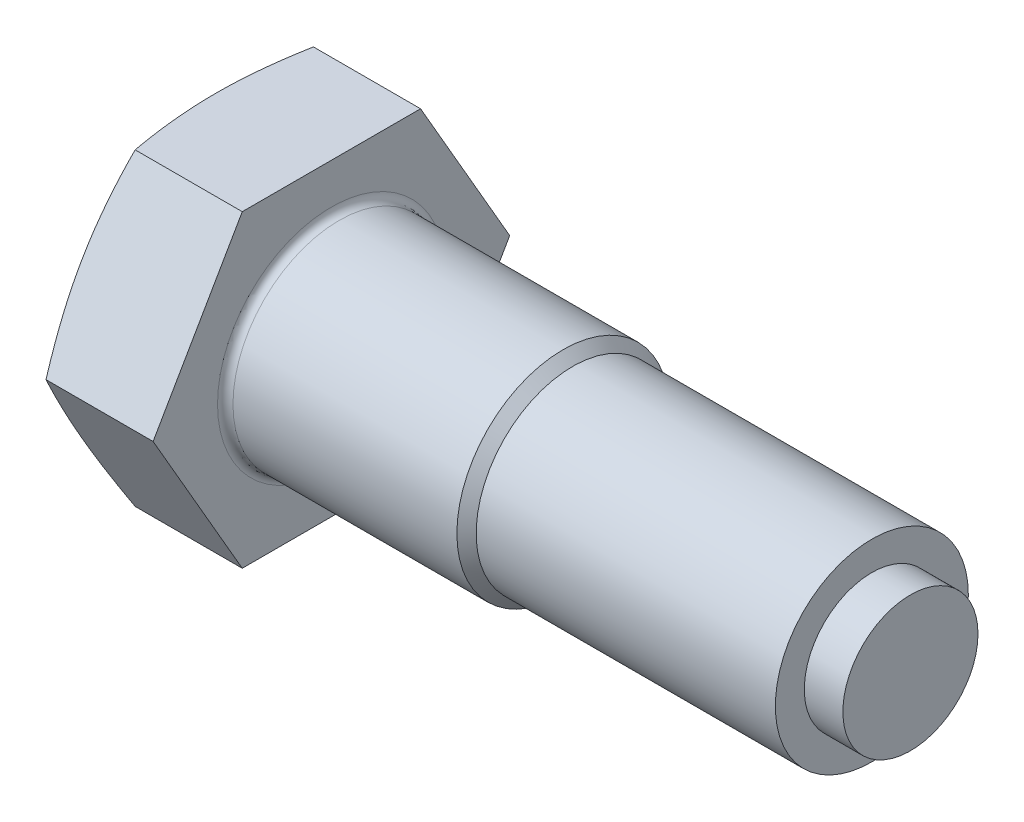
ISO-10303-21;
HEADER;
FILE_DESCRIPTION(('STEP AP214'),'2;1');
FILE_NAME('part.step','',(''),(''),'','','');
FILE_SCHEMA(('AUTOMOTIVE_DESIGN { 1 0 10303 214 1 1 1 1 }'));
ENDSEC;
DATA;
#1=APPLICATION_CONTEXT('core data for automotive mechanical design processes');
#2=APPLICATION_PROTOCOL_DEFINITION('international standard','automotive_design',2000,#1);
#3=PRODUCT_CONTEXT('',#1,'mechanical');
#4=PRODUCT('Part','Part','',(#3));
#5=PRODUCT_RELATED_PRODUCT_CATEGORY('part','',(#4));
#6=PRODUCT_DEFINITION_FORMATION('','',#4);
#7=PRODUCT_DEFINITION_CONTEXT('part definition',#1,'design');
#8=PRODUCT_DEFINITION('design','',#6,#7);
#9=PRODUCT_DEFINITION_SHAPE('','',#8);
#10=(LENGTH_UNIT() NAMED_UNIT(*) SI_UNIT(.MILLI.,.METRE.));
#11=(NAMED_UNIT(*) PLANE_ANGLE_UNIT() SI_UNIT($,.RADIAN.));
#12=(NAMED_UNIT(*) SI_UNIT($,.STERADIAN.) SOLID_ANGLE_UNIT());
#13=UNCERTAINTY_MEASURE_WITH_UNIT(LENGTH_MEASURE(1.E-05),#10,'distance_accuracy_value','');
#14=(GEOMETRIC_REPRESENTATION_CONTEXT(3) GLOBAL_UNCERTAINTY_ASSIGNED_CONTEXT((#13)) GLOBAL_UNIT_ASSIGNED_CONTEXT((#10,
#11,#12)) REPRESENTATION_CONTEXT('',''));
#15=CARTESIAN_POINT('',(0.,0.,0.));
#16=DIRECTION('',(0.,0.,1.));
#17=DIRECTION('',(1.,0.,0.));
#18=AXIS2_PLACEMENT_3D('',#15,#16,#17);
#19=CARTESIAN_POINT('',(6.,-8.,-4.61880215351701));
#20=DIRECTION('',(0.,0.5,0.866025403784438));
#21=DIRECTION('',(0.,-0.866025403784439,0.5));
#22=AXIS2_PLACEMENT_3D('',#19,#20,#21);
#23=PLANE('',#22);
#24=CARTESIAN_POINT('',(0.450493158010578,0.00020000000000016,-9.23771977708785));
#25=CARTESIAN_POINT('',(0.380845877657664,-0.331114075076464,-9.04643550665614));
#26=CARTESIAN_POINT('',(0.317489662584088,-0.663520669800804,-8.85452046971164));
#27=CARTESIAN_POINT('',(0.206024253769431,-1.33049516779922,-8.46944256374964));
#28=CARTESIAN_POINT('',(0.157926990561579,-1.66506455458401,-8.27627883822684));
#29=CARTESIAN_POINT('',(0.0801310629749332,-2.33265174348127,-7.89084719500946));
#30=CARTESIAN_POINT('',(0.0502627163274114,-2.66565429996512,-7.69858807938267));
#31=CARTESIAN_POINT('',(0.0102008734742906,-3.33243813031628,-7.31362025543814));
#32=CARTESIAN_POINT('',(0.,-3.66621906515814,-7.12091174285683));
#33=CARTESIAN_POINT('',(0.,-4.33378093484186,-6.7354947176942));
#34=CARTESIAN_POINT('',(0.0102008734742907,-4.66756186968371,-6.54278620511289));
#35=CARTESIAN_POINT('',(0.0502627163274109,-5.33434570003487,-6.15781838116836));
#36=CARTESIAN_POINT('',(0.0801310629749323,-5.66734825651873,-5.96555926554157));
#37=CARTESIAN_POINT('',(0.157926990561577,-6.33493544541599,-5.58012762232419));
#38=CARTESIAN_POINT('',(0.20602425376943,-6.66950483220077,-5.38696389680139));
#39=CARTESIAN_POINT('',(0.317489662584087,-7.33647933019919,-5.00188599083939));
#40=CARTESIAN_POINT('',(0.380845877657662,-7.66888592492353,-4.80997095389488));
#41=CARTESIAN_POINT('',(0.450493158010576,-8.0002,-4.61868668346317));
#42=B_SPLINE_CURVE_WITH_KNOTS('',3,(#24,#25,#26,#27,#28,#29,#30,#31,#32,#33,#34,#35,#36,#37,#38,
#39,#40,#41),.UNSPECIFIED.,.F.,.F.,(4,2,2,2,2,2,2,2,4),(0.,1.16669003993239,2.33429004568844,
3.4908488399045,4.6469737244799,5.80309860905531,6.95965740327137,8.12725740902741,
9.2939474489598),.UNSPECIFIED.);
#43=CARTESIAN_POINT('',(0.450451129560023,0.,-9.23760430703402));
#44=VERTEX_POINT('',#43);
#45=CARTESIAN_POINT('',(0.,-4.,-6.92820323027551));
#46=VERTEX_POINT('',#45);
#47=EDGE_CURVE('E113',#44,#46,#42,.T.);
#48=ORIENTED_EDGE('',*,*,#47,.F.);
#49=DIRECTION('',(-1.,0.,0.));
#50=VECTOR('',#49,1.);
#51=CARTESIAN_POINT('',(6.,0.,-9.23760430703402));
#52=LINE('',#51,#50);
#53=CARTESIAN_POINT('',(6.,0.,-9.23760430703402));
#54=VERTEX_POINT('',#53);
#55=EDGE_CURVE('E142',#54,#44,#52,.T.);
#56=ORIENTED_EDGE('',*,*,#55,.F.);
#57=DIRECTION('',(0.,0.866025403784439,-0.5));
#58=VECTOR('',#57,1.);
#59=CARTESIAN_POINT('',(6.,-8.,-4.61880215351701));
#60=LINE('',#59,#58);
#61=CARTESIAN_POINT('',(6.,-8.,-4.61880215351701));
#62=VERTEX_POINT('',#61);
#63=EDGE_CURVE('E179',#62,#54,#60,.T.);
#64=ORIENTED_EDGE('',*,*,#63,.F.);
#65=DIRECTION('',(-1.,0.,0.));
#66=VECTOR('',#65,1.);
#67=CARTESIAN_POINT('',(6.,-8.,-4.61880215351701));
#68=LINE('',#67,#66);
#69=CARTESIAN_POINT('',(0.450451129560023,-8.,-4.61880215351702));
#70=VERTEX_POINT('',#69);
#71=EDGE_CURVE('E136',#62,#70,#68,.T.);
#72=ORIENTED_EDGE('',*,*,#71,.T.);
#73=EDGE_CURVE('E200',#46,#70,#42,.T.);
#74=ORIENTED_EDGE('',*,*,#73,.F.);
#75=EDGE_LOOP('',(#48,#56,#64,#72,#74));
#76=FACE_BOUND('',#75,.T.);
#77=ADVANCED_FACE('F35',(#76),#23,.F.);
#78=CARTESIAN_POINT('',(6.,0.,-9.23760430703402));
#79=DIRECTION('',(0.,-0.5,0.866025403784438));
#80=DIRECTION('',(0.,-0.866025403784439,-0.5));
#81=AXIS2_PLACEMENT_3D('',#78,#79,#80);
#82=PLANE('',#81);
#83=CARTESIAN_POINT('',(0.450493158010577,8.0002,-4.61868668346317));
#84=CARTESIAN_POINT('',(0.380845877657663,7.66888592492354,-4.80997095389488));
#85=CARTESIAN_POINT('',(0.317489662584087,7.3364793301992,-5.00188599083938));
#86=CARTESIAN_POINT('',(0.206024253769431,6.66950483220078,-5.38696389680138));
#87=CARTESIAN_POINT('',(0.157926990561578,6.33493544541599,-5.58012762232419));
#88=CARTESIAN_POINT('',(0.0801310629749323,5.66734825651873,-5.96555926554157));
#89=CARTESIAN_POINT('',(0.0502627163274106,5.33434570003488,-6.15781838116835));
#90=CARTESIAN_POINT('',(0.0102008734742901,4.66756186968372,-6.54278620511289));
#91=CARTESIAN_POINT('',(0.,4.33378093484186,-6.7354947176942));
#92=CARTESIAN_POINT('',(0.,3.66621906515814,-7.12091174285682));
#93=CARTESIAN_POINT('',(0.0102008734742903,3.33243813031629,-7.31362025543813));
#94=CARTESIAN_POINT('',(0.050262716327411,2.66565429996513,-7.69858807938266));
#95=CARTESIAN_POINT('',(0.080131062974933,2.33265174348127,-7.89084719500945));
#96=CARTESIAN_POINT('',(0.157926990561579,1.66506455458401,-8.27627883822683));
#97=CARTESIAN_POINT('',(0.206024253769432,1.33049516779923,-8.46944256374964));
#98=CARTESIAN_POINT('',(0.317489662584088,0.663520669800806,-8.85452046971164));
#99=CARTESIAN_POINT('',(0.380845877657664,0.331114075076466,-9.04643550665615));
#100=CARTESIAN_POINT('',(0.450493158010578,-0.000199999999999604,-9.23771977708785));
#101=B_SPLINE_CURVE_WITH_KNOTS('',3,(#83,#84,#85,#86,#87,#88,#89,#90,#91,#92,#93,#94,#95,#96,
#97,#98,#99,#100),.UNSPECIFIED.,.F.,.F.,(4,2,2,2,2,2,2,2,4),(0.,1.16669003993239,
2.33429004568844,3.4908488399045,4.6469737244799,5.80309860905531,6.95965740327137,
8.12725740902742,9.29394744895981),.UNSPECIFIED.);
#102=CARTESIAN_POINT('',(0.450451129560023,8.,-4.61880215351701));
#103=VERTEX_POINT('',#102);
#104=CARTESIAN_POINT('',(0.,4.,-6.92820323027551));
#105=VERTEX_POINT('',#104);
#106=EDGE_CURVE('E252',#103,#105,#101,.T.);
#107=ORIENTED_EDGE('',*,*,#106,.F.);
#108=DIRECTION('',(-1.,0.,0.));
#109=VECTOR('',#108,1.);
#110=CARTESIAN_POINT('',(6.,8.,-4.618802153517));
#111=LINE('',#110,#109);
#112=CARTESIAN_POINT('',(6.,8.,-4.618802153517));
#113=VERTEX_POINT('',#112);
#114=EDGE_CURVE('E133',#113,#103,#111,.T.);
#115=ORIENTED_EDGE('',*,*,#114,.F.);
#116=DIRECTION('',(0.,0.866025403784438,0.5));
#117=VECTOR('',#116,1.);
#118=CARTESIAN_POINT('',(6.,0.,-9.23760430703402));
#119=LINE('',#118,#117);
#120=EDGE_CURVE('E182',#54,#113,#119,.T.);
#121=ORIENTED_EDGE('',*,*,#120,.F.);
#122=ORIENTED_EDGE('',*,*,#55,.T.);
#123=EDGE_CURVE('E125',#105,#44,#101,.T.);
#124=ORIENTED_EDGE('',*,*,#123,.F.);
#125=EDGE_LOOP('',(#107,#115,#121,#122,#124));
#126=FACE_BOUND('',#125,.T.);
#127=ADVANCED_FACE('F258',(#126),#82,.F.);
#128=CARTESIAN_POINT('',(6.,8.,-4.618802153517));
#129=DIRECTION('',(0.,-1.,0.));
#130=DIRECTION('',(0.,0.,-1.));
#131=AXIS2_PLACEMENT_3D('',#128,#129,#130);
#132=PLANE('',#131);
#133=CARTESIAN_POINT('',(2.40703219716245,8.,-12.2289640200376));
#134=CARTESIAN_POINT('',(2.29681888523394,8.,-11.8670150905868));
#135=CARTESIAN_POINT('',(2.18789161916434,8.,-11.504667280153));
#136=CARTESIAN_POINT('',(1.97332061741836,8.,-10.778970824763));
#137=CARTESIAN_POINT('',(1.86767714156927,8.,-10.4156221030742));
#138=CARTESIAN_POINT('',(1.66020942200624,8.,-9.68709884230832));
#139=CARTESIAN_POINT('',(1.55839267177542,8.,-9.32192216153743));
#140=CARTESIAN_POINT('',(1.35977040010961,8.,-8.59021038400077));
#141=CARTESIAN_POINT('',(1.26296478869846,8.,-8.22367531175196));
#142=CARTESIAN_POINT('',(1.07676087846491,8.,-7.49353181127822));
#143=CARTESIAN_POINT('',(0.987285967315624,8.,-7.12994301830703));
#144=CARTESIAN_POINT('',(0.815953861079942,8.,-6.40095616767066));
#145=CARTESIAN_POINT('',(0.734096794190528,8.,-6.03555807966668));
#146=CARTESIAN_POINT('',(0.579908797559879,8.,-5.3028708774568));
#147=CARTESIAN_POINT('',(0.507574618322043,8.,-4.93558245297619));
#148=CARTESIAN_POINT('',(0.374634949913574,8.,-4.19887324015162));
#149=CARTESIAN_POINT('',(0.314029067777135,8.,-3.82945252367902));
#150=CARTESIAN_POINT('',(0.21300896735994,8.,-3.13007695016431));
#151=CARTESIAN_POINT('',(0.171092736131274,8.,-2.80034108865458));
#152=CARTESIAN_POINT('',(0.100138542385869,8.,-2.13947507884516));
#153=CARTESIAN_POINT('',(0.0711002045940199,8.,-1.80834497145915));
#154=CARTESIAN_POINT('',(0.0273002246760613,8.,-1.14536212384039));
#155=CARTESIAN_POINT('',(0.0125284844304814,8.,-0.81351006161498));
#156=CARTESIAN_POINT('',(-0.00199041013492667,8.,-0.149473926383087));
#157=CARTESIAN_POINT('',(-0.00173767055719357,8.,0.182710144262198));
#158=CARTESIAN_POINT('',(0.013818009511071,8.,0.848405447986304));
#159=CARTESIAN_POINT('',(0.0291972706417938,8.,1.18191486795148));
#160=CARTESIAN_POINT('',(0.074298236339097,8.,1.84795410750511));
#161=CARTESIAN_POINT('',(0.104020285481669,8.,2.18048390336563));
#162=CARTESIAN_POINT('',(0.176416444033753,8.,2.84439969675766));
#163=CARTESIAN_POINT('',(0.21910167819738,8.,3.17578446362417));
#164=CARTESIAN_POINT('',(0.315692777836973,8.,3.83689615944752));
#165=CARTESIAN_POINT('',(0.369598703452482,8.,4.16662307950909));
#166=CARTESIAN_POINT('',(0.489978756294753,8.,4.84177010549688));
#167=CARTESIAN_POINT('',(0.55696686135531,8.,5.18709775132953));
#168=CARTESIAN_POINT('',(0.699564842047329,8.,5.87597970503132));
#169=CARTESIAN_POINT('',(0.775175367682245,8.,6.21953387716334));
#170=CARTESIAN_POINT('',(0.933430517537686,8.,6.90511369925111));
#171=CARTESIAN_POINT('',(1.016077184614,8.,7.24713887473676));
#172=CARTESIAN_POINT('',(1.18706021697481,8.,7.92974842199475));
#173=CARTESIAN_POINT('',(1.27539644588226,8.,8.27033282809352));
#174=CARTESIAN_POINT('',(1.45681143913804,8.,8.95070023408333));
#175=CARTESIAN_POINT('',(1.54989614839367,8.00000000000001,9.29048164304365));
#176=CARTESIAN_POINT('',(1.73985237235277,8.00000000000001,9.96898283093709));
#177=CARTESIAN_POINT('',(1.83672390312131,8.00000000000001,10.3077026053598));
#178=CARTESIAN_POINT('',(2.03355925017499,8.00000000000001,10.9841773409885));
#179=CARTESIAN_POINT('',(2.13352253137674,8.00000000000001,11.3219324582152));
#180=CARTESIAN_POINT('',(2.33602454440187,8.00000000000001,11.996670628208));
#181=CARTESIAN_POINT('',(2.43856329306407,8.00000000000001,12.3336536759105));
#182=CARTESIAN_POINT('',(2.74708830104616,8.00000000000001,13.3361794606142));
#183=CARTESIAN_POINT('',(2.95617894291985,8.00000000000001,14.0007666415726));
#184=CARTESIAN_POINT('',(3.3802854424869,8.00000000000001,15.3280732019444));
#185=CARTESIAN_POINT('',(3.59530158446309,8.00000000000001,15.9907924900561));
#186=CARTESIAN_POINT('',(4.02885489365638,8.00000000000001,17.3122918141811));
#187=CARTESIAN_POINT('',(4.24737560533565,8.00000000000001,17.9710772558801));
#188=CARTESIAN_POINT('',(4.57758071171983,8.00000000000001,18.9584130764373));
#189=CARTESIAN_POINT('',(4.6880485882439,8.00000000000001,19.2873713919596));
#190=CARTESIAN_POINT('',(4.90969914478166,8.00000000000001,19.9450462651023));
#191=CARTESIAN_POINT('',(5.02088182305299,8.00000000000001,20.2737628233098));
#192=CARTESIAN_POINT('',(5.13237415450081,8.00000000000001,20.6023743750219));
#193=B_SPLINE_CURVE_WITH_KNOTS('',3,(#133,#134,#135,#136,#137,#138,#139,#140,#141,#142,#143,
#144,#145,#146,#147,#148,#149,#150,#151,#152,#153,#154,#155,#156,#157,#158,#159,#160,#161,#162,
#163,#164,#165,#166,#167,#168,#169,#170,#171,#172,#173,#174,#175,#176,#177,#178,#179,#180,#181,
#182,#183,#184,#185,#186,#187,#188,#189,#190,#191,#192),.UNSPECIFIED.,.F.,.F.,(4,2,2,2,2,2,2,2,
2,2,2,2,2,2,2,2,2,2,2,2,2,2,2,2,2,2,2,2,2,4),(0.,1.13507897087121,2.27024752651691,
3.40753402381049,4.54480009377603,5.66804425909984,6.79130732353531,7.91418609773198,
9.0370272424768,10.033976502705,11.0308967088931,12.0271107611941,13.0233177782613,
14.0245770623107,15.0258604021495,16.0280054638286,17.0301558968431,18.0853158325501,
19.1405553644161,20.1961023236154,21.2516239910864,22.3085012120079,23.3653829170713,
24.4220827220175,25.4787894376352,27.5688531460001,29.6590173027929,31.7412506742,
32.7822834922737,33.8233137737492),.UNSPECIFIED.);
#194=CARTESIAN_POINT('',(0.450451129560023,8.00000000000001,4.618802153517));
#195=VERTEX_POINT('',#194);
#196=CARTESIAN_POINT('',(0.,8.,0.));
#197=VERTEX_POINT('',#196);
#198=EDGE_CURVE('E50',#195,#197,#193,.F.);
#199=ORIENTED_EDGE('',*,*,#198,.F.);
#200=DIRECTION('',(-1.,0.,0.));
#201=VECTOR('',#200,1.);
#202=CARTESIAN_POINT('',(6.,8.,4.618802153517));
#203=LINE('',#202,#201);
#204=CARTESIAN_POINT('',(6.,8.,4.618802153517));
#205=VERTEX_POINT('',#204);
#206=EDGE_CURVE('E130',#205,#195,#203,.T.);
#207=ORIENTED_EDGE('',*,*,#206,.F.);
#208=DIRECTION('',(0.,0.,1.));
#209=VECTOR('',#208,1.);
#210=CARTESIAN_POINT('',(6.,8.,-4.618802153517));
#211=LINE('',#210,#209);
#212=EDGE_CURVE('E188',#113,#205,#211,.T.);
#213=ORIENTED_EDGE('',*,*,#212,.F.);
#214=ORIENTED_EDGE('',*,*,#114,.T.);
#215=EDGE_CURVE('E253',#197,#103,#193,.F.);
#216=ORIENTED_EDGE('',*,*,#215,.F.);
#217=EDGE_LOOP('',(#199,#207,#213,#214,#216));
#218=FACE_BOUND('',#217,.T.);
#219=ADVANCED_FACE('F261',(#218),#132,.F.);
#220=CARTESIAN_POINT('',(6.,8.,4.618802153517));
#221=DIRECTION('',(0.,-0.5,-0.866025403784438));
#222=DIRECTION('',(0.,0.866025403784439,-0.5));
#223=AXIS2_PLACEMENT_3D('',#220,#221,#222);
#224=PLANE('',#223);
#225=CARTESIAN_POINT('',(0.450493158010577,-0.000200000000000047,9.23771977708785));
#226=CARTESIAN_POINT('',(0.380845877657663,0.331114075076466,9.04643550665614));
#227=CARTESIAN_POINT('',(0.317489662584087,0.663520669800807,8.85452046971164));
#228=CARTESIAN_POINT('',(0.206024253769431,1.33049516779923,8.46944256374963));
#229=CARTESIAN_POINT('',(0.157926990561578,1.66506455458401,8.27627883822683));
#230=CARTESIAN_POINT('',(0.0801310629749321,2.33265174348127,7.89084719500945));
#231=CARTESIAN_POINT('',(0.0502627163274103,2.66565429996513,7.69858807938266));
#232=CARTESIAN_POINT('',(0.0102008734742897,3.33243813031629,7.31362025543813));
#233=CARTESIAN_POINT('',(0.,3.66621906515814,7.12091174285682));
#234=CARTESIAN_POINT('',(0.,4.33378093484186,6.7354947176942));
#235=CARTESIAN_POINT('',(0.0102008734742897,4.66756186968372,6.54278620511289));
#236=CARTESIAN_POINT('',(0.0502627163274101,5.33434570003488,6.15781838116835));
#237=CARTESIAN_POINT('',(0.0801310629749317,5.66734825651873,5.96555926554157));
#238=CARTESIAN_POINT('',(0.157926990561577,6.33493544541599,5.58012762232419));
#239=CARTESIAN_POINT('',(0.206024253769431,6.66950483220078,5.38696389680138));
#240=CARTESIAN_POINT('',(0.317489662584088,7.3364793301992,5.00188599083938));
#241=CARTESIAN_POINT('',(0.380845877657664,7.66888592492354,4.80997095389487));
#242=CARTESIAN_POINT('',(0.450493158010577,8.0002,4.61868668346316));
#243=B_SPLINE_CURVE_WITH_KNOTS('',3,(#225,#226,#227,#228,#229,#230,#231,#232,#233,#234,#235,
#236,#237,#238,#239,#240,#241,#242),.UNSPECIFIED.,.F.,.F.,(4,2,2,2,2,2,2,2,4),(0.,
1.16669003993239,2.33429004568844,3.4908488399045,4.64697372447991,5.80309860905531,
6.95965740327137,8.12725740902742,9.29394744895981),.UNSPECIFIED.);
#244=CARTESIAN_POINT('',(0.450451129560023,0.,9.23760430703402));
#245=VERTEX_POINT('',#244);
#246=CARTESIAN_POINT('',(0.,4.,6.92820323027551));
#247=VERTEX_POINT('',#246);
#248=EDGE_CURVE('E58',#245,#247,#243,.T.);
#249=ORIENTED_EDGE('',*,*,#248,.F.);
#250=DIRECTION('',(-1.,0.,0.));
#251=VECTOR('',#250,1.);
#252=CARTESIAN_POINT('',(6.,0.,9.23760430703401));
#253=LINE('',#252,#251);
#254=CARTESIAN_POINT('',(6.,0.,9.23760430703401));
#255=VERTEX_POINT('',#254);
#256=EDGE_CURVE('E121',#255,#245,#253,.T.);
#257=ORIENTED_EDGE('',*,*,#256,.F.);
#258=DIRECTION('',(0.,-0.866025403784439,0.5));
#259=VECTOR('',#258,1.);
#260=CARTESIAN_POINT('',(6.,8.,4.618802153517));
#261=LINE('',#260,#259);
#262=EDGE_CURVE('E190',#205,#255,#261,.T.);
#263=ORIENTED_EDGE('',*,*,#262,.F.);
#264=ORIENTED_EDGE('',*,*,#206,.T.);
#265=EDGE_CURVE('E124',#247,#195,#243,.T.);
#266=ORIENTED_EDGE('',*,*,#265,.F.);
#267=EDGE_LOOP('',(#249,#257,#263,#264,#266));
#268=FACE_BOUND('',#267,.T.);
#269=ADVANCED_FACE('F119',(#268),#224,.F.);
#270=CARTESIAN_POINT('',(6.,0.,9.23760430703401));
#271=DIRECTION('',(0.,0.5,-0.866025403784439));
#272=DIRECTION('',(0.,0.866025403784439,0.5));
#273=AXIS2_PLACEMENT_3D('',#270,#271,#272);
#274=PLANE('',#273);
#275=CARTESIAN_POINT('',(0.450493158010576,-8.0002,4.61868668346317));
#276=CARTESIAN_POINT('',(0.380845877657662,-7.66888592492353,4.80997095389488));
#277=CARTESIAN_POINT('',(0.317489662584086,-7.33647933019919,5.00188599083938));
#278=CARTESIAN_POINT('',(0.206024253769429,-6.66950483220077,5.38696389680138));
#279=CARTESIAN_POINT('',(0.157926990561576,-6.33493544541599,5.58012762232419));
#280=CARTESIAN_POINT('',(0.0801310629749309,-5.66734825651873,5.96555926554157));
#281=CARTESIAN_POINT('',(0.0502627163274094,-5.33434570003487,6.15781838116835));
#282=CARTESIAN_POINT('',(0.0102008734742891,-4.66756186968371,6.54278620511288));
#283=CARTESIAN_POINT('',(0.,-4.33378093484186,6.7354947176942));
#284=CARTESIAN_POINT('',(0.,-3.66621906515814,7.12091174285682));
#285=CARTESIAN_POINT('',(0.010200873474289,-3.33243813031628,7.31362025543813));
#286=CARTESIAN_POINT('',(0.0502627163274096,-2.66565429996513,7.69858807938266));
#287=CARTESIAN_POINT('',(0.0801310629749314,-2.33265174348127,7.89084719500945));
#288=CARTESIAN_POINT('',(0.157926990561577,-1.66506455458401,8.27627883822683));
#289=CARTESIAN_POINT('',(0.20602425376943,-1.33049516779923,8.46944256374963));
#290=CARTESIAN_POINT('',(0.317489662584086,-0.663520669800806,8.85452046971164));
#291=CARTESIAN_POINT('',(0.380845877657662,-0.331114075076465,9.04643550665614));
#292=CARTESIAN_POINT('',(0.450493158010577,0.000199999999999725,9.23771977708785));
#293=B_SPLINE_CURVE_WITH_KNOTS('',3,(#275,#276,#277,#278,#279,#280,#281,#282,#283,#284,#285,
#286,#287,#288,#289,#290,#291,#292),.UNSPECIFIED.,.F.,.F.,(4,2,2,2,2,2,2,2,4),(0.,
1.16669003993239,2.33429004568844,3.4908488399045,4.6469737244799,5.80309860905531,
6.95965740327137,8.12725740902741,9.29394744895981),.UNSPECIFIED.);
#294=CARTESIAN_POINT('',(0.450451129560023,-8.,4.61880215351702));
#295=VERTEX_POINT('',#294);
#296=CARTESIAN_POINT('',(0.,-4.,6.92820323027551));
#297=VERTEX_POINT('',#296);
#298=EDGE_CURVE('E115',#295,#297,#293,.T.);
#299=ORIENTED_EDGE('',*,*,#298,.F.);
#300=DIRECTION('',(-1.,0.,0.));
#301=VECTOR('',#300,1.);
#302=CARTESIAN_POINT('',(6.,-8.,4.618802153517));
#303=LINE('',#302,#301);
#304=CARTESIAN_POINT('',(6.,-8.,4.618802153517));
#305=VERTEX_POINT('',#304);
#306=EDGE_CURVE('E131',#305,#295,#303,.T.);
#307=ORIENTED_EDGE('',*,*,#306,.F.);
#308=DIRECTION('',(0.,-0.866025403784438,-0.5));
#309=VECTOR('',#308,1.);
#310=CARTESIAN_POINT('',(6.,0.,9.23760430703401));
#311=LINE('',#310,#309);
#312=EDGE_CURVE('E129',#255,#305,#311,.T.);
#313=ORIENTED_EDGE('',*,*,#312,.F.);
#314=ORIENTED_EDGE('',*,*,#256,.T.);
#315=EDGE_CURVE('E105',#297,#245,#293,.T.);
#316=ORIENTED_EDGE('',*,*,#315,.F.);
#317=EDGE_LOOP('',(#299,#307,#313,#314,#316));
#318=FACE_BOUND('',#317,.T.);
#319=ADVANCED_FACE('F127',(#318),#274,.F.);
#320=CARTESIAN_POINT('',(6.,-8.,4.618802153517));
#321=DIRECTION('',(0.,1.,0.));
#322=DIRECTION('',(0.,0.,1.));
#323=AXIS2_PLACEMENT_3D('',#320,#321,#322);
#324=PLANE('',#323);
#325=CARTESIAN_POINT('',(2.40703219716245,-7.99999999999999,-12.2289640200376));
#326=CARTESIAN_POINT('',(2.29681888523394,-7.99999999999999,-11.8670150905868));
#327=CARTESIAN_POINT('',(2.18789161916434,-7.99999999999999,-11.504667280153));
#328=CARTESIAN_POINT('',(1.97332061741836,-7.99999999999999,-10.778970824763));
#329=CARTESIAN_POINT('',(1.86767714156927,-7.99999999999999,-10.4156221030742));
#330=CARTESIAN_POINT('',(1.66020942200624,-7.99999999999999,-9.68709884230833));
#331=CARTESIAN_POINT('',(1.55839267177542,-8.,-9.32192216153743));
#332=CARTESIAN_POINT('',(1.35977040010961,-8.,-8.59021038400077));
#333=CARTESIAN_POINT('',(1.26296478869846,-8.,-8.22367531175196));
#334=CARTESIAN_POINT('',(1.0767608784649,-8.,-7.49353181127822));
#335=CARTESIAN_POINT('',(0.987285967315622,-8.,-7.12994301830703));
#336=CARTESIAN_POINT('',(0.81595386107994,-8.,-6.40095616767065));
#337=CARTESIAN_POINT('',(0.734096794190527,-8.,-6.03555807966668));
#338=CARTESIAN_POINT('',(0.579908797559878,-8.,-5.3028708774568));
#339=CARTESIAN_POINT('',(0.507574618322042,-8.,-4.93558245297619));
#340=CARTESIAN_POINT('',(0.374634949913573,-8.,-4.19887324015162));
#341=CARTESIAN_POINT('',(0.314029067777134,-8.,-3.82945252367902));
#342=CARTESIAN_POINT('',(0.213008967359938,-8.,-3.13007695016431));
#343=CARTESIAN_POINT('',(0.171092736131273,-8.,-2.80034108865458));
#344=CARTESIAN_POINT('',(0.100138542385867,-8.,-2.13947507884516));
#345=CARTESIAN_POINT('',(0.0711002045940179,-8.,-1.80834497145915));
#346=CARTESIAN_POINT('',(0.0273002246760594,-8.,-1.14536212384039));
#347=CARTESIAN_POINT('',(0.0125284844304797,-8.,-0.813510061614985));
#348=CARTESIAN_POINT('',(-0.00199041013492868,-8.,-0.149473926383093));
#349=CARTESIAN_POINT('',(-0.00173767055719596,-8.,0.182710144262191));
#350=CARTESIAN_POINT('',(0.0138180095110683,-8.,0.848405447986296));
#351=CARTESIAN_POINT('',(0.0291972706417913,-8.,1.18191486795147));
#352=CARTESIAN_POINT('',(0.0742982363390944,-8.,1.8479541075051));
#353=CARTESIAN_POINT('',(0.104020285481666,-8.,2.18048390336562));
#354=CARTESIAN_POINT('',(0.176416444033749,-8.,2.84439969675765));
#355=CARTESIAN_POINT('',(0.219101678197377,-8.,3.17578446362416));
#356=CARTESIAN_POINT('',(0.315692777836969,-8.,3.83689615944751));
#357=CARTESIAN_POINT('',(0.369598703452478,-8.,4.16662307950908));
#358=CARTESIAN_POINT('',(0.48997875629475,-8.,4.84177010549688));
#359=CARTESIAN_POINT('',(0.556966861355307,-8.,5.18709775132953));
#360=CARTESIAN_POINT('',(0.699564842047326,-8.,5.87597970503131));
#361=CARTESIAN_POINT('',(0.775175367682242,-8.,6.21953387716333));
#362=CARTESIAN_POINT('',(0.933430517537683,-8.,6.90511369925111));
#363=CARTESIAN_POINT('',(1.01607718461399,-8.,7.24713887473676));
#364=CARTESIAN_POINT('',(1.18706021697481,-8.,7.92974842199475));
#365=CARTESIAN_POINT('',(1.27539644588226,-8.,8.27033282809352));
#366=CARTESIAN_POINT('',(1.45681143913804,-8.,8.95070023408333));
#367=CARTESIAN_POINT('',(1.54989614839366,-8.,9.29048164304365));
#368=CARTESIAN_POINT('',(1.73985237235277,-8.,9.96898283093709));
#369=CARTESIAN_POINT('',(1.83672390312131,-8.,10.3077026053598));
#370=CARTESIAN_POINT('',(2.03355925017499,-8.,10.9841773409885));
#371=CARTESIAN_POINT('',(2.13352253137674,-8.,11.3219324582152));
#372=CARTESIAN_POINT('',(2.33602454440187,-8.,11.996670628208));
#373=CARTESIAN_POINT('',(2.43856329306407,-8.,12.3336536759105));
#374=CARTESIAN_POINT('',(2.74708830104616,-8.,13.3361794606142));
#375=CARTESIAN_POINT('',(2.95617894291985,-8.,14.0007666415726));
#376=CARTESIAN_POINT('',(3.3802854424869,-8.,15.3280732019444));
#377=CARTESIAN_POINT('',(3.59530158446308,-8.,15.9907924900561));
#378=CARTESIAN_POINT('',(4.02885489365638,-8.,17.3122918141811));
#379=CARTESIAN_POINT('',(4.24737560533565,-8.,17.9710772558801));
#380=CARTESIAN_POINT('',(4.57758071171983,-8.,18.9584130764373));
#381=CARTESIAN_POINT('',(4.6880485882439,-8.,19.2873713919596));
#382=CARTESIAN_POINT('',(4.90969914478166,-8.,19.9450462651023));
#383=CARTESIAN_POINT('',(5.02088182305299,-8.,20.2737628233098));
#384=CARTESIAN_POINT('',(5.13237415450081,-8.,20.6023743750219));
#385=B_SPLINE_CURVE_WITH_KNOTS('',3,(#325,#326,#327,#328,#329,#330,#331,#332,#333,#334,#335,
#336,#337,#338,#339,#340,#341,#342,#343,#344,#345,#346,#347,#348,#349,#350,#351,#352,#353,#354,
#355,#356,#357,#358,#359,#360,#361,#362,#363,#364,#365,#366,#367,#368,#369,#370,#371,#372,#373,
#374,#375,#376,#377,#378,#379,#380,#381,#382,#383,#384),.UNSPECIFIED.,.F.,.F.,(4,2,2,2,2,2,2,2,
2,2,2,2,2,2,2,2,2,2,2,2,2,2,2,2,2,2,2,2,2,4),(0.,1.13507897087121,2.27024752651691,
3.4075340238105,4.54480009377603,5.66804425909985,6.79130732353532,7.91418609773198,
9.0370272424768,10.033976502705,11.0308967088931,12.0271107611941,13.0233177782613,
14.0245770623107,15.0258604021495,16.0280054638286,17.0301558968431,18.0853158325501,
19.1405553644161,20.1961023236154,21.2516239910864,22.3085012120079,23.3653829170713,
24.4220827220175,25.4787894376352,27.5688531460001,29.6590173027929,31.7412506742,
32.7822834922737,33.8233137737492),.UNSPECIFIED.);
#386=CARTESIAN_POINT('',(0.,-8.,0.));
#387=VERTEX_POINT('',#386);
#388=EDGE_CURVE('E208',#70,#387,#385,.T.);
#389=ORIENTED_EDGE('',*,*,#388,.F.);
#390=ORIENTED_EDGE('',*,*,#71,.F.);
#391=DIRECTION('',(0.,0.,-1.));
#392=VECTOR('',#391,1.);
#393=CARTESIAN_POINT('',(6.,-8.,4.618802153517));
#394=LINE('',#393,#392);
#395=EDGE_CURVE('E193',#305,#62,#394,.T.);
#396=ORIENTED_EDGE('',*,*,#395,.F.);
#397=ORIENTED_EDGE('',*,*,#306,.T.);
#398=EDGE_CURVE('E209',#387,#295,#385,.T.);
#399=ORIENTED_EDGE('',*,*,#398,.F.);
#400=EDGE_LOOP('',(#389,#390,#396,#397,#399));
#401=FACE_BOUND('',#400,.T.);
#402=ADVANCED_FACE('F205',(#401),#324,.F.);
#403=CARTESIAN_POINT('',(80.142135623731,0.,0.));
#404=DIRECTION('',(-1.,0.,0.));
#405=DIRECTION('',(0.,0.,1.));
#406=AXIS2_PLACEMENT_3D('',#403,#404,#405);
#407=CYLINDRICAL_SURFACE('',#406,5.);
#408=CARTESIAN_POINT('',(18.5,0.,0.));
#409=DIRECTION('',(1.,0.,0.));
#410=DIRECTION('',(0.,0.,-1.));
#411=AXIS2_PLACEMENT_3D('',#408,#409,#410);
#412=CIRCLE('',#411,5.);
#413=CARTESIAN_POINT('',(18.5,0.,-5.));
#414=VERTEX_POINT('',#413);
#415=EDGE_CURVE('E13',#414,#414,#412,.T.);
#416=ORIENTED_EDGE('',*,*,#415,.T.);
#417=EDGE_LOOP('',(#416));
#418=FACE_BOUND('',#417,.T.);
#419=CARTESIAN_POINT('',(34.,0.,0.));
#420=DIRECTION('',(1.,0.,0.));
#421=DIRECTION('',(0.,0.,-1.));
#422=AXIS2_PLACEMENT_3D('',#419,#420,#421);
#423=CIRCLE('',#422,5.);
#424=CARTESIAN_POINT('',(34.,0.,-5.));
#425=VERTEX_POINT('',#424);
#426=EDGE_CURVE('E146',#425,#425,#423,.T.);
#427=ORIENTED_EDGE('',*,*,#426,.F.);
#428=EDGE_LOOP('',(#427));
#429=FACE_BOUND('',#428,.T.);
#430=ADVANCED_FACE('F273',(#418,#429),#407,.T.);
#431=CARTESIAN_POINT('',(6.,0.,-9.23760430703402));
#432=DIRECTION('',(1.,0.,0.));
#433=DIRECTION('',(0.,0.,-1.));
#434=AXIS2_PLACEMENT_3D('',#431,#432,#433);
#435=PLANE('',#434);
#436=CARTESIAN_POINT('',(6.,0.,0.));
#437=DIRECTION('',(1.,0.,0.));
#438=DIRECTION('',(0.,0.,-1.));
#439=AXIS2_PLACEMENT_3D('',#436,#437,#438);
#440=CIRCLE('',#439,5.9);
#441=CARTESIAN_POINT('',(6.,0.,-5.9));
#442=VERTEX_POINT('',#441);
#443=EDGE_CURVE('E43',#442,#442,#440,.F.);
#444=ORIENTED_EDGE('',*,*,#443,.T.);
#445=EDGE_LOOP('',(#444));
#446=FACE_BOUND('',#445,.T.);
#447=ORIENTED_EDGE('',*,*,#63,.T.);
#448=ORIENTED_EDGE('',*,*,#120,.T.);
#449=ORIENTED_EDGE('',*,*,#212,.T.);
#450=ORIENTED_EDGE('',*,*,#262,.T.);
#451=ORIENTED_EDGE('',*,*,#312,.T.);
#452=ORIENTED_EDGE('',*,*,#395,.T.);
#453=EDGE_LOOP('',(#447,#448,#449,#450,#451,#452));
#454=FACE_BOUND('',#453,.T.);
#455=ADVANCED_FACE('F160',(#446,#454),#435,.T.);
#456=CARTESIAN_POINT('',(18.,0.,0.));
#457=DIRECTION('',(-1.,0.,0.));
#458=DIRECTION('',(0.,0.,1.));
#459=AXIS2_PLACEMENT_3D('',#456,#457,#458);
#460=CYLINDRICAL_SURFACE('',#459,5.5);
#461=CARTESIAN_POINT('',(6.4,0.,0.));
#462=DIRECTION('',(1.,0.,0.));
#463=DIRECTION('',(0.,0.,-1.));
#464=AXIS2_PLACEMENT_3D('',#461,#462,#463);
#465=CIRCLE('',#464,5.5);
#466=CARTESIAN_POINT('',(6.4,0.,-5.5));
#467=VERTEX_POINT('',#466);
#468=EDGE_CURVE('E155',#467,#467,#465,.T.);
#469=ORIENTED_EDGE('',*,*,#468,.T.);
#470=EDGE_LOOP('',(#469));
#471=FACE_BOUND('',#470,.T.);
#472=CARTESIAN_POINT('',(18.,0.,0.));
#473=DIRECTION('',(1.,0.,0.));
#474=DIRECTION('',(0.,0.,-1.));
#475=AXIS2_PLACEMENT_3D('',#472,#473,#474);
#476=CIRCLE('',#475,5.5);
#477=CARTESIAN_POINT('',(18.,0.,-5.5));
#478=VERTEX_POINT('',#477);
#479=EDGE_CURVE('E149',#478,#478,#476,.T.);
#480=ORIENTED_EDGE('',*,*,#479,.F.);
#481=EDGE_LOOP('',(#480));
#482=FACE_BOUND('',#481,.T.);
#483=ADVANCED_FACE('F171',(#471,#482),#460,.T.);
#484=CARTESIAN_POINT('',(34.,0.,0.));
#485=DIRECTION('',(1.,0.,0.));
#486=DIRECTION('',(0.,0.,-1.));
#487=AXIS2_PLACEMENT_3D('',#484,#485,#486);
#488=PLANE('',#487);
#489=CARTESIAN_POINT('',(34.,0.,0.));
#490=DIRECTION('',(1.,0.,0.));
#491=DIRECTION('',(0.,0.,-1.));
#492=AXIS2_PLACEMENT_3D('',#489,#490,#491);
#493=CIRCLE('',#492,3.5);
#494=CARTESIAN_POINT('',(34.,0.,-3.5));
#495=VERTEX_POINT('',#494);
#496=EDGE_CURVE('E150',#495,#495,#493,.T.);
#497=ORIENTED_EDGE('',*,*,#496,.F.);
#498=EDGE_LOOP('',(#497));
#499=FACE_BOUND('',#498,.T.);
#500=ORIENTED_EDGE('',*,*,#426,.T.);
#501=EDGE_LOOP('',(#500));
#502=FACE_BOUND('',#501,.T.);
#503=ADVANCED_FACE('F174',(#499,#502),#488,.T.);
#504=CARTESIAN_POINT('',(34.,0.,0.));
#505=DIRECTION('',(1.,0.,0.));
#506=DIRECTION('',(0.,0.,-1.));
#507=AXIS2_PLACEMENT_3D('',#504,#505,#506);
#508=CYLINDRICAL_SURFACE('',#507,3.5);
#509=ORIENTED_EDGE('',*,*,#496,.T.);
#510=EDGE_LOOP('',(#509));
#511=FACE_BOUND('',#510,.T.);
#512=CARTESIAN_POINT('',(36.,0.,0.));
#513=DIRECTION('',(1.,0.,0.));
#514=DIRECTION('',(0.,0.,-1.));
#515=AXIS2_PLACEMENT_3D('',#512,#513,#514);
#516=CIRCLE('',#515,3.5);
#517=CARTESIAN_POINT('',(36.,0.,-3.5));
#518=VERTEX_POINT('',#517);
#519=EDGE_CURVE('E416',#518,#518,#516,.T.);
#520=ORIENTED_EDGE('',*,*,#519,.F.);
#521=EDGE_LOOP('',(#520));
#522=FACE_BOUND('',#521,.T.);
#523=ADVANCED_FACE('F233',(#511,#522),#508,.T.);
#524=CARTESIAN_POINT('',(36.,0.,-9.23760430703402));
#525=DIRECTION('',(1.,0.,0.));
#526=DIRECTION('',(0.,0.,-1.));
#527=AXIS2_PLACEMENT_3D('',#524,#525,#526);
#528=PLANE('',#527);
#529=ORIENTED_EDGE('',*,*,#519,.T.);
#530=EDGE_LOOP('',(#529));
#531=FACE_BOUND('',#530,.T.);
#532=ADVANCED_FACE('F313',(#531),#528,.T.);
#533=CARTESIAN_POINT('',(0.,0.,0.));
#534=DIRECTION('',(1.,0.,0.));
#535=DIRECTION('',(0.,0.,-1.));
#536=AXIS2_PLACEMENT_3D('',#533,#534,#535);
#537=CONICAL_SURFACE('',#536,8.,1.22173047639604);
#538=ORIENTED_EDGE('',*,*,#123,.T.);
#539=ORIENTED_EDGE('',*,*,#47,.T.);
#540=CARTESIAN_POINT('',(0.,0.,0.));
#541=DIRECTION('',(1.,0.,0.));
#542=DIRECTION('',(0.,0.,-1.));
#543=AXIS2_PLACEMENT_3D('',#540,#541,#542);
#544=CIRCLE('',#543,8.);
#545=EDGE_CURVE('E145',#46,#105,#544,.T.);
#546=ORIENTED_EDGE('',*,*,#545,.T.);
#547=EDGE_LOOP('',(#538,#539,#546));
#548=FACE_BOUND('',#547,.T.);
#549=ADVANCED_FACE('F307',(#548),#537,.T.);
#550=ORIENTED_EDGE('',*,*,#73,.T.);
#551=ORIENTED_EDGE('',*,*,#388,.T.);
#552=EDGE_CURVE('E153',#387,#46,#544,.T.);
#553=ORIENTED_EDGE('',*,*,#552,.T.);
#554=EDGE_LOOP('',(#550,#551,#553));
#555=FACE_BOUND('',#554,.T.);
#556=ADVANCED_FACE('F312',(#555),#537,.T.);
#557=ORIENTED_EDGE('',*,*,#298,.T.);
#558=EDGE_CURVE('E428',#297,#387,#544,.T.);
#559=ORIENTED_EDGE('',*,*,#558,.T.);
#560=ORIENTED_EDGE('',*,*,#398,.T.);
#561=EDGE_LOOP('',(#557,#559,#560));
#562=FACE_BOUND('',#561,.T.);
#563=ADVANCED_FACE('F231',(#562),#537,.T.);
#564=ORIENTED_EDGE('',*,*,#248,.T.);
#565=EDGE_CURVE('E108',#247,#297,#544,.T.);
#566=ORIENTED_EDGE('',*,*,#565,.T.);
#567=ORIENTED_EDGE('',*,*,#315,.T.);
#568=EDGE_LOOP('',(#564,#566,#567));
#569=FACE_BOUND('',#568,.T.);
#570=ADVANCED_FACE('F106',(#569),#537,.T.);
#571=ORIENTED_EDGE('',*,*,#198,.T.);
#572=CARTESIAN_POINT('',(0.,0.,0.));
#573=DIRECTION('',(-1.,0.,0.));
#574=DIRECTION('',(0.,0.,1.));
#575=AXIS2_PLACEMENT_3D('',#572,#573,#574);
#576=CIRCLE('',#575,8.);
#577=EDGE_CURVE('E212',#247,#197,#576,.T.);
#578=ORIENTED_EDGE('',*,*,#577,.F.);
#579=ORIENTED_EDGE('',*,*,#265,.T.);
#580=EDGE_LOOP('',(#571,#578,#579));
#581=FACE_BOUND('',#580,.T.);
#582=ADVANCED_FACE('F226',(#581),#537,.T.);
#583=ORIENTED_EDGE('',*,*,#215,.T.);
#584=ORIENTED_EDGE('',*,*,#106,.T.);
#585=EDGE_CURVE('E154',#105,#197,#544,.T.);
#586=ORIENTED_EDGE('',*,*,#585,.T.);
#587=EDGE_LOOP('',(#583,#584,#586));
#588=FACE_BOUND('',#587,.T.);
#589=ADVANCED_FACE('F230',(#588),#537,.T.);
#590=CARTESIAN_POINT('',(0.,0.,-9.23760430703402));
#591=DIRECTION('',(1.,0.,0.));
#592=DIRECTION('',(0.,0.,-1.));
#593=AXIS2_PLACEMENT_3D('',#590,#591,#592);
#594=PLANE('',#593);
#595=ORIENTED_EDGE('',*,*,#585,.F.);
#596=ORIENTED_EDGE('',*,*,#545,.F.);
#597=ORIENTED_EDGE('',*,*,#552,.F.);
#598=ORIENTED_EDGE('',*,*,#558,.F.);
#599=ORIENTED_EDGE('',*,*,#565,.F.);
#600=ORIENTED_EDGE('',*,*,#577,.T.);
#601=EDGE_LOOP('',(#595,#596,#597,#598,#599,#600));
#602=FACE_BOUND('',#601,.T.);
#603=ADVANCED_FACE('F167',(#602),#594,.F.);
#604=CARTESIAN_POINT('',(6.4,0.,0.));
#605=DIRECTION('',(1.,0.,0.));
#606=DIRECTION('',(0.,0.,-1.));
#607=AXIS2_PLACEMENT_3D('',#604,#605,#606);
#608=TOROIDAL_SURFACE('',#607,5.9,0.4);
#609=ORIENTED_EDGE('',*,*,#443,.F.);
#610=EDGE_LOOP('',(#609));
#611=FACE_BOUND('',#610,.T.);
#612=ORIENTED_EDGE('',*,*,#468,.F.);
#613=EDGE_LOOP('',(#612));
#614=FACE_BOUND('',#613,.T.);
#615=ADVANCED_FACE('F163',(#611,#614),#608,.F.);
#616=CARTESIAN_POINT('',(18.5,0.,0.));
#617=DIRECTION('',(-1.,0.,0.));
#618=DIRECTION('',(0.,0.,1.));
#619=AXIS2_PLACEMENT_3D('',#616,#617,#618);
#620=CONICAL_SURFACE('',#619,5.,0.785398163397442);
#621=ORIENTED_EDGE('',*,*,#479,.T.);
#622=EDGE_LOOP('',(#621));
#623=FACE_BOUND('',#622,.T.);
#624=ORIENTED_EDGE('',*,*,#415,.F.);
#625=EDGE_LOOP('',(#624));
#626=FACE_BOUND('',#625,.T.);
#627=ADVANCED_FACE('F166',(#623,#626),#620,.T.);
#628=CLOSED_SHELL('',(#77,#127,#219,#269,#319,#402,#430,#455,#483,#503,#523,#532,#549,#556,#563,
#570,#582,#589,#603,#615,#627));
#629=MANIFOLD_SOLID_BREP('B2',#628);
#630=ADVANCED_BREP_SHAPE_REPRESENTATION('',(#18,#629),#14);
#631=SHAPE_DEFINITION_REPRESENTATION(#9,#630);
ENDSEC;
END-ISO-10303-21;
